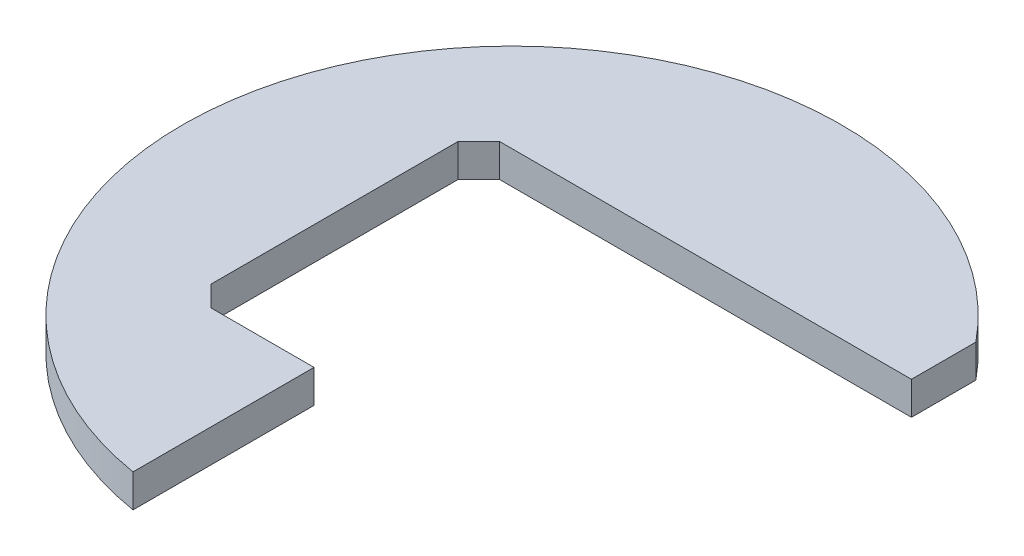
from build123d import *

# Parameters (mm, degrees)
BOSS_EXTRUDE1_DEPTH = 1.6


with BuildPart() as part:
    # Sketch1 → Boss-Extrude1 (new body)
    with BuildSketch(Plane(origin=(0, 0, 0), x_dir=(1, 0, 0), z_dir=(0, 1, 0))):
        with BuildLine():
            Line((-7.61250543, 7), (-8.61250543, 6))
            Line((-8.61250543, 6), (-8.61250543, -6))
            Line((-8.61250543, -6), (-7.61250543, -7))
            Line((-7.61250543, -7), (-2.61250543, -7))
            Line((-2.61250543, -7), (-2.61250543, -15.785272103))
            ThreePointArc((-2.61250543, -15.785272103), (-13.847206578, 8.015913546), (12.38749457, 10.126696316))
            Line((12.38749457, 10.126696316), (12.38749457, 7))
            Line((12.38749457, 7), (-7.61250543, 7))
        make_face()
    extrude(amount=BOSS_EXTRUDE1_DEPTH)


solid = part.part
